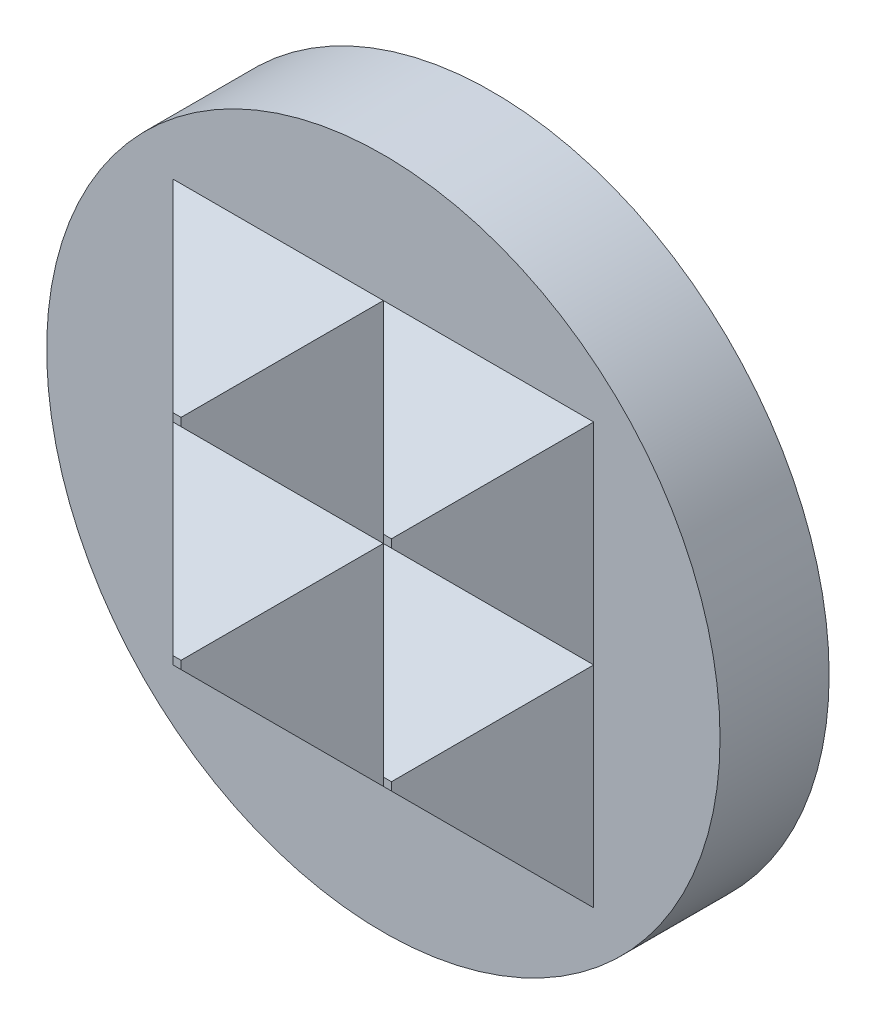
ISO-10303-21;
HEADER;
FILE_DESCRIPTION(('STEP AP214'),'2;1');
FILE_NAME('part.step','',(''),(''),'','','');
FILE_SCHEMA(('AUTOMOTIVE_DESIGN { 1 0 10303 214 1 1 1 1 }'));
ENDSEC;
DATA;
#1=APPLICATION_CONTEXT('core data for automotive mechanical design processes');
#2=APPLICATION_PROTOCOL_DEFINITION('international standard','automotive_design',2000,#1);
#3=PRODUCT_CONTEXT('',#1,'mechanical');
#4=PRODUCT('Part','Part','',(#3));
#5=PRODUCT_RELATED_PRODUCT_CATEGORY('part','',(#4));
#6=PRODUCT_DEFINITION_FORMATION('','',#4);
#7=PRODUCT_DEFINITION_CONTEXT('part definition',#1,'design');
#8=PRODUCT_DEFINITION('design','',#6,#7);
#9=PRODUCT_DEFINITION_SHAPE('','',#8);
#10=(LENGTH_UNIT() NAMED_UNIT(*) SI_UNIT(.MILLI.,.METRE.));
#11=(NAMED_UNIT(*) PLANE_ANGLE_UNIT() SI_UNIT($,.RADIAN.));
#12=(NAMED_UNIT(*) SI_UNIT($,.STERADIAN.) SOLID_ANGLE_UNIT());
#13=UNCERTAINTY_MEASURE_WITH_UNIT(LENGTH_MEASURE(1.E-05),#10,'distance_accuracy_value','');
#14=(GEOMETRIC_REPRESENTATION_CONTEXT(3) GLOBAL_UNCERTAINTY_ASSIGNED_CONTEXT((#13)) GLOBAL_UNIT_ASSIGNED_CONTEXT((#10,
#11,#12)) REPRESENTATION_CONTEXT('',''));
#15=CARTESIAN_POINT('',(0.,0.,0.));
#16=DIRECTION('',(0.,0.,1.));
#17=DIRECTION('',(1.,0.,0.));
#18=AXIS2_PLACEMENT_3D('',#15,#16,#17);
#19=CARTESIAN_POINT('',(6.351,3.96748,2.5654));
#20=DIRECTION('',(0.,-0.707106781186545,-0.70710678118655));
#21=DIRECTION('',(0.,0.70710678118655,-0.707106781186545));
#22=AXIS2_PLACEMENT_3D('',#19,#20,#21);
#23=PLANE('',#22);
#24=DIRECTION('',(-1.,0.,0.));
#25=VECTOR('',#24,1.);
#26=CARTESIAN_POINT('',(6.351,2.05994,4.47294));
#27=LINE('',#26,#25);
#28=CARTESIAN_POINT('',(2.05994,2.05994,4.47294));
#29=VERTEX_POINT('',#28);
#30=CARTESIAN_POINT('',(1.90754,2.05994,4.47294));
#31=VERTEX_POINT('',#30);
#32=EDGE_CURVE('E144',#29,#31,#27,.T.);
#33=ORIENTED_EDGE('',*,*,#32,.F.);
#34=DIRECTION('',(0.577350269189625,0.577350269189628,-0.577350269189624));
#35=VECTOR('',#34,1.);
#36=CARTESIAN_POINT('',(4.76198666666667,4.76198666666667,1.77089333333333));
#37=LINE('',#36,#35);
#38=CARTESIAN_POINT('',(3.96748,3.96748,2.5654));
#39=VERTEX_POINT('',#38);
#40=EDGE_CURVE('E220',#29,#39,#37,.T.);
#41=ORIENTED_EDGE('',*,*,#40,.T.);
#42=DIRECTION('',(-1.,0.,0.));
#43=VECTOR('',#42,1.);
#44=CARTESIAN_POINT('',(6.351,3.96748,2.5654));
#45=LINE('',#44,#43);
#46=CARTESIAN_POINT('',(0.,3.96748,2.5654));
#47=VERTEX_POINT('',#46);
#48=EDGE_CURVE('E157',#39,#47,#45,.T.);
#49=ORIENTED_EDGE('',*,*,#48,.T.);
#50=DIRECTION('',(0.577350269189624,-0.577350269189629,0.577350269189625));
#51=VECTOR('',#50,1.);
#52=CARTESIAN_POINT('',(2.117,1.85048,4.6824));
#53=LINE('',#52,#51);
#54=EDGE_CURVE('E187',#47,#31,#53,.T.);
#55=ORIENTED_EDGE('',*,*,#54,.T.);
#56=EDGE_LOOP('',(#33,#41,#49,#55));
#57=FACE_BOUND('',#56,.T.);
#58=ADVANCED_FACE('F14',(#57),#23,.F.);
#59=CARTESIAN_POINT('',(6.351,2.05994,4.47294));
#60=DIRECTION('',(0.,0.,-1.));
#61=DIRECTION('',(-1.,0.,0.));
#62=AXIS2_PLACEMENT_3D('',#59,#60,#61);
#63=PLANE('',#62);
#64=DIRECTION('',(-1.,0.,0.));
#65=VECTOR('',#64,1.);
#66=CARTESIAN_POINT('',(6.351,1.90754,4.47294));
#67=LINE('',#66,#65);
#68=CARTESIAN_POINT('',(2.05994,1.90754,4.47294));
#69=VERTEX_POINT('',#68);
#70=CARTESIAN_POINT('',(1.90754,1.90754,4.47294));
#71=VERTEX_POINT('',#70);
#72=EDGE_CURVE('E148',#69,#71,#67,.T.);
#73=ORIENTED_EDGE('',*,*,#72,.F.);
#74=DIRECTION('',(0.,1.,0.));
#75=VECTOR('',#74,1.);
#76=CARTESIAN_POINT('',(2.05994,2.05994,4.47294));
#77=LINE('',#76,#75);
#78=EDGE_CURVE('E222',#69,#29,#77,.T.);
#79=ORIENTED_EDGE('',*,*,#78,.T.);
#80=ORIENTED_EDGE('',*,*,#32,.T.);
#81=DIRECTION('',(0.,-1.,0.));
#82=VECTOR('',#81,1.);
#83=CARTESIAN_POINT('',(1.90754,2.05994,4.47294));
#84=LINE('',#83,#82);
#85=EDGE_CURVE('E189',#31,#71,#84,.T.);
#86=ORIENTED_EDGE('',*,*,#85,.T.);
#87=EDGE_LOOP('',(#73,#79,#80,#86));
#88=FACE_BOUND('',#87,.T.);
#89=ADVANCED_FACE('F285',(#88),#63,.F.);
#90=CARTESIAN_POINT('',(6.351,0.,2.5654));
#91=DIRECTION('',(0.,0.707106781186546,-0.70710678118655));
#92=DIRECTION('',(0.,0.70710678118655,0.707106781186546));
#93=AXIS2_PLACEMENT_3D('',#90,#91,#92);
#94=PLANE('',#93);
#95=DIRECTION('',(-1.,0.,0.));
#96=VECTOR('',#95,1.);
#97=CARTESIAN_POINT('',(6.351,0.,2.5654));
#98=LINE('',#97,#96);
#99=CARTESIAN_POINT('',(3.96748,0.,2.5654));
#100=VERTEX_POINT('',#99);
#101=CARTESIAN_POINT('',(0.,0.,2.5654));
#102=VERTEX_POINT('',#101);
#103=EDGE_CURVE('E18',#100,#102,#98,.T.);
#104=ORIENTED_EDGE('',*,*,#103,.F.);
#105=DIRECTION('',(-0.577350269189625,0.577350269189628,0.577350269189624));
#106=VECTOR('',#105,1.);
#107=CARTESIAN_POINT('',(4.76198666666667,-0.794506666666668,1.77089333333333));
#108=LINE('',#107,#106);
#109=EDGE_CURVE('E225',#100,#69,#108,.T.);
#110=ORIENTED_EDGE('',*,*,#109,.T.);
#111=ORIENTED_EDGE('',*,*,#72,.T.);
#112=DIRECTION('',(-0.577350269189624,-0.577350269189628,-0.577350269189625));
#113=VECTOR('',#112,1.);
#114=CARTESIAN_POINT('',(2.117,2.117,4.6824));
#115=LINE('',#114,#113);
#116=EDGE_CURVE('E192',#71,#102,#115,.T.);
#117=ORIENTED_EDGE('',*,*,#116,.T.);
#118=EDGE_LOOP('',(#104,#110,#111,#117));
#119=FACE_BOUND('',#118,.T.);
#120=ADVANCED_FACE('F246',(#119),#94,.F.);
#121=CARTESIAN_POINT('',(6.35105,-1.90754,4.47294));
#122=DIRECTION('',(0.,0.,-1.));
#123=DIRECTION('',(-1.,0.,0.));
#124=AXIS2_PLACEMENT_3D('',#121,#122,#123);
#125=PLANE('',#124);
#126=DIRECTION('',(-1.,0.,0.));
#127=VECTOR('',#126,1.);
#128=CARTESIAN_POINT('',(6.35105,-2.05994,4.47294));
#129=LINE('',#128,#127);
#130=CARTESIAN_POINT('',(2.05994,-2.05994,4.47294));
#131=VERTEX_POINT('',#130);
#132=CARTESIAN_POINT('',(1.90754,-2.05994,4.47294));
#133=VERTEX_POINT('',#132);
#134=EDGE_CURVE('E138',#131,#133,#129,.T.);
#135=ORIENTED_EDGE('',*,*,#134,.F.);
#136=DIRECTION('',(0.,1.,0.));
#137=VECTOR('',#136,1.);
#138=CARTESIAN_POINT('',(2.05994,-1.90754,4.47294));
#139=LINE('',#138,#137);
#140=CARTESIAN_POINT('',(2.05994,-1.90754,4.47294));
#141=VERTEX_POINT('',#140);
#142=EDGE_CURVE('E32',#131,#141,#139,.T.);
#143=ORIENTED_EDGE('',*,*,#142,.T.);
#144=DIRECTION('',(-1.,0.,0.));
#145=VECTOR('',#144,1.);
#146=CARTESIAN_POINT('',(6.35105,-1.90754,4.47294));
#147=LINE('',#146,#145);
#148=CARTESIAN_POINT('',(1.90754,-1.90754,4.47294));
#149=VERTEX_POINT('',#148);
#150=EDGE_CURVE('E119',#141,#149,#147,.T.);
#151=ORIENTED_EDGE('',*,*,#150,.T.);
#152=DIRECTION('',(0.,-1.,0.));
#153=VECTOR('',#152,1.);
#154=CARTESIAN_POINT('',(1.90754,-1.90754,4.47294));
#155=LINE('',#154,#153);
#156=EDGE_CURVE('E198',#149,#133,#155,.T.);
#157=ORIENTED_EDGE('',*,*,#156,.T.);
#158=EDGE_LOOP('',(#135,#143,#151,#157));
#159=FACE_BOUND('',#158,.T.);
#160=ADVANCED_FACE('F310',(#159),#125,.F.);
#161=CARTESIAN_POINT('',(6.35105,0.,2.5654));
#162=DIRECTION('',(0.,-0.707106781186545,-0.70710678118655));
#163=DIRECTION('',(0.,0.70710678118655,-0.707106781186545));
#164=AXIS2_PLACEMENT_3D('',#161,#162,#163);
#165=PLANE('',#164);
#166=ORIENTED_EDGE('',*,*,#150,.F.);
#167=DIRECTION('',(0.577350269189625,0.577350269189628,-0.577350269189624));
#168=VECTOR('',#167,1.);
#169=CARTESIAN_POINT('',(4.76200333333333,0.794523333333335,1.77087666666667));
#170=LINE('',#169,#168);
#171=EDGE_CURVE('E228',#141,#100,#170,.T.);
#172=ORIENTED_EDGE('',*,*,#171,.T.);
#173=ORIENTED_EDGE('',*,*,#103,.T.);
#174=DIRECTION('',(0.577350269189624,-0.577350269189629,0.577350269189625));
#175=VECTOR('',#174,1.);
#176=CARTESIAN_POINT('',(2.11701666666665,-2.11701666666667,4.68241666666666));
#177=LINE('',#176,#175);
#178=EDGE_CURVE('E195',#102,#149,#177,.T.);
#179=ORIENTED_EDGE('',*,*,#178,.T.);
#180=EDGE_LOOP('',(#166,#172,#173,#179));
#181=FACE_BOUND('',#180,.T.);
#182=ADVANCED_FACE('F243',(#181),#165,.F.);
#183=CARTESIAN_POINT('',(6.35105,-3.96748,2.5654));
#184=DIRECTION('',(0.,0.707106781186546,-0.70710678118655));
#185=DIRECTION('',(0.,0.70710678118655,0.707106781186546));
#186=AXIS2_PLACEMENT_3D('',#183,#184,#185);
#187=PLANE('',#186);
#188=DIRECTION('',(-1.,0.,0.));
#189=VECTOR('',#188,1.);
#190=CARTESIAN_POINT('',(6.35105,-3.96748,2.5654));
#191=LINE('',#190,#189);
#192=CARTESIAN_POINT('',(3.96748,-3.96748,2.5654));
#193=VERTEX_POINT('',#192);
#194=CARTESIAN_POINT('',(0.,-3.96748,2.5654));
#195=VERTEX_POINT('',#194);
#196=EDGE_CURVE('E117',#193,#195,#191,.T.);
#197=ORIENTED_EDGE('',*,*,#196,.F.);
#198=DIRECTION('',(-0.577350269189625,0.577350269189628,0.577350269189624));
#199=VECTOR('',#198,1.);
#200=CARTESIAN_POINT('',(4.76200333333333,-4.76200333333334,1.77087666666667));
#201=LINE('',#200,#199);
#202=EDGE_CURVE('E232',#193,#131,#201,.T.);
#203=ORIENTED_EDGE('',*,*,#202,.T.);
#204=ORIENTED_EDGE('',*,*,#134,.T.);
#205=DIRECTION('',(-0.577350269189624,-0.577350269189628,-0.577350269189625));
#206=VECTOR('',#205,1.);
#207=CARTESIAN_POINT('',(2.11701666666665,-1.85046333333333,4.68241666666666));
#208=LINE('',#207,#206);
#209=EDGE_CURVE('E201',#133,#195,#208,.T.);
#210=ORIENTED_EDGE('',*,*,#209,.T.);
#211=EDGE_LOOP('',(#197,#203,#204,#210));
#212=FACE_BOUND('',#211,.T.);
#213=ADVANCED_FACE('F296',(#212),#187,.F.);
#214=CARTESIAN_POINT('',(-1.90754,2.05994,4.47294));
#215=VERTEX_POINT('',#214);
#216=CARTESIAN_POINT('',(-2.05994,2.05994,4.47294));
#217=VERTEX_POINT('',#216);
#218=EDGE_CURVE('E147',#215,#217,#27,.T.);
#219=ORIENTED_EDGE('',*,*,#218,.F.);
#220=DIRECTION('',(0.577350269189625,0.577350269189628,-0.577350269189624));
#221=VECTOR('',#220,1.);
#222=CARTESIAN_POINT('',(2.117,6.08448,0.4484));
#223=LINE('',#222,#221);
#224=EDGE_CURVE('E172',#215,#47,#223,.T.);
#225=ORIENTED_EDGE('',*,*,#224,.T.);
#226=CARTESIAN_POINT('',(-3.96748,3.96748,2.5654));
#227=VERTEX_POINT('',#226);
#228=EDGE_CURVE('E140',#47,#227,#45,.T.);
#229=ORIENTED_EDGE('',*,*,#228,.T.);
#230=DIRECTION('',(0.577350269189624,-0.577350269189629,0.577350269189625));
#231=VECTOR('',#230,1.);
#232=CARTESIAN_POINT('',(-0.527986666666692,0.527986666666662,6.00489333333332));
#233=LINE('',#232,#231);
#234=EDGE_CURVE('E171',#227,#217,#233,.T.);
#235=ORIENTED_EDGE('',*,*,#234,.T.);
#236=EDGE_LOOP('',(#219,#225,#229,#235));
#237=FACE_BOUND('',#236,.T.);
#238=ADVANCED_FACE('F170',(#237),#23,.F.);
#239=CARTESIAN_POINT('',(-1.90754,1.90754,4.47294));
#240=VERTEX_POINT('',#239);
#241=CARTESIAN_POINT('',(-2.05994,1.90754,4.47294));
#242=VERTEX_POINT('',#241);
#243=EDGE_CURVE('E146',#240,#242,#67,.T.);
#244=ORIENTED_EDGE('',*,*,#243,.F.);
#245=DIRECTION('',(0.,1.,0.));
#246=VECTOR('',#245,1.);
#247=CARTESIAN_POINT('',(-1.90754,2.05994,4.47294));
#248=LINE('',#247,#246);
#249=EDGE_CURVE('E205',#240,#215,#248,.T.);
#250=ORIENTED_EDGE('',*,*,#249,.T.);
#251=ORIENTED_EDGE('',*,*,#218,.T.);
#252=DIRECTION('',(0.,-1.,0.));
#253=VECTOR('',#252,1.);
#254=CARTESIAN_POINT('',(-2.05994,2.05994,4.47294));
#255=LINE('',#254,#253);
#256=EDGE_CURVE('E179',#217,#242,#255,.T.);
#257=ORIENTED_EDGE('',*,*,#256,.T.);
#258=EDGE_LOOP('',(#244,#250,#251,#257));
#259=FACE_BOUND('',#258,.T.);
#260=ADVANCED_FACE('F293',(#259),#63,.F.);
#261=CARTESIAN_POINT('',(-3.96748,0.,2.5654));
#262=VERTEX_POINT('',#261);
#263=EDGE_CURVE('E149',#102,#262,#98,.T.);
#264=ORIENTED_EDGE('',*,*,#263,.F.);
#265=DIRECTION('',(-0.577350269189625,0.577350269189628,0.577350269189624));
#266=VECTOR('',#265,1.);
#267=CARTESIAN_POINT('',(2.117,-2.117,0.4484));
#268=LINE('',#267,#266);
#269=EDGE_CURVE('E208',#102,#240,#268,.T.);
#270=ORIENTED_EDGE('',*,*,#269,.T.);
#271=ORIENTED_EDGE('',*,*,#243,.T.);
#272=DIRECTION('',(-0.577350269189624,-0.577350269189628,-0.577350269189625));
#273=VECTOR('',#272,1.);
#274=CARTESIAN_POINT('',(-0.527986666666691,3.43949333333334,6.00489333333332));
#275=LINE('',#274,#273);
#276=EDGE_CURVE('E181',#242,#262,#275,.T.);
#277=ORIENTED_EDGE('',*,*,#276,.T.);
#278=EDGE_LOOP('',(#264,#270,#271,#277));
#279=FACE_BOUND('',#278,.T.);
#280=ADVANCED_FACE('F302',(#279),#94,.F.);
#281=CARTESIAN_POINT('',(-1.90754,-2.05994,4.47294));
#282=VERTEX_POINT('',#281);
#283=CARTESIAN_POINT('',(-2.05994,-2.05994,4.47294));
#284=VERTEX_POINT('',#283);
#285=EDGE_CURVE('E135',#282,#284,#129,.T.);
#286=ORIENTED_EDGE('',*,*,#285,.F.);
#287=DIRECTION('',(0.,1.,0.));
#288=VECTOR('',#287,1.);
#289=CARTESIAN_POINT('',(-1.90754,-1.90754,4.47294));
#290=LINE('',#289,#288);
#291=CARTESIAN_POINT('',(-1.90754,-1.90754,4.47294));
#292=VERTEX_POINT('',#291);
#293=EDGE_CURVE('E40',#282,#292,#290,.T.);
#294=ORIENTED_EDGE('',*,*,#293,.T.);
#295=CARTESIAN_POINT('',(-2.05994,-1.90754,4.47294));
#296=VERTEX_POINT('',#295);
#297=EDGE_CURVE('E180',#292,#296,#147,.T.);
#298=ORIENTED_EDGE('',*,*,#297,.T.);
#299=DIRECTION('',(0.,-1.,0.));
#300=VECTOR('',#299,1.);
#301=CARTESIAN_POINT('',(-2.05994,-1.90754,4.47294));
#302=LINE('',#301,#300);
#303=EDGE_CURVE('E130',#296,#284,#302,.T.);
#304=ORIENTED_EDGE('',*,*,#303,.T.);
#305=EDGE_LOOP('',(#286,#294,#298,#304));
#306=FACE_BOUND('',#305,.T.);
#307=ADVANCED_FACE('F319',(#306),#125,.F.);
#308=ORIENTED_EDGE('',*,*,#297,.F.);
#309=DIRECTION('',(0.577350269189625,0.577350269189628,-0.577350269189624));
#310=VECTOR('',#309,1.);
#311=CARTESIAN_POINT('',(2.11701666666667,2.11701666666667,0.44838333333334));
#312=LINE('',#311,#310);
#313=EDGE_CURVE('E211',#292,#102,#312,.T.);
#314=ORIENTED_EDGE('',*,*,#313,.T.);
#315=ORIENTED_EDGE('',*,*,#263,.T.);
#316=DIRECTION('',(0.577350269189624,-0.577350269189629,0.577350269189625));
#317=VECTOR('',#316,1.);
#318=CARTESIAN_POINT('',(-0.527970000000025,-3.43951,6.00491));
#319=LINE('',#318,#317);
#320=EDGE_CURVE('E128',#262,#296,#319,.T.);
#321=ORIENTED_EDGE('',*,*,#320,.T.);
#322=EDGE_LOOP('',(#308,#314,#315,#321));
#323=FACE_BOUND('',#322,.T.);
#324=ADVANCED_FACE('F312',(#323),#165,.F.);
#325=CARTESIAN_POINT('',(-3.96748,-3.96748,2.5654));
#326=VERTEX_POINT('',#325);
#327=EDGE_CURVE('E110',#195,#326,#191,.T.);
#328=ORIENTED_EDGE('',*,*,#327,.F.);
#329=DIRECTION('',(-0.577350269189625,0.577350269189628,0.577350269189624));
#330=VECTOR('',#329,1.);
#331=CARTESIAN_POINT('',(2.11701666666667,-6.08449666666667,0.44838333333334));
#332=LINE('',#331,#330);
#333=EDGE_CURVE('E136',#195,#282,#332,.T.);
#334=ORIENTED_EDGE('',*,*,#333,.T.);
#335=ORIENTED_EDGE('',*,*,#285,.T.);
#336=DIRECTION('',(-0.577350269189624,-0.577350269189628,-0.577350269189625));
#337=VECTOR('',#336,1.);
#338=CARTESIAN_POINT('',(-0.527970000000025,-0.52797,6.00491));
#339=LINE('',#338,#337);
#340=EDGE_CURVE('E9',#284,#326,#339,.T.);
#341=ORIENTED_EDGE('',*,*,#340,.T.);
#342=EDGE_LOOP('',(#328,#334,#335,#341));
#343=FACE_BOUND('',#342,.T.);
#344=ADVANCED_FACE('F133',(#343),#187,.F.);
#345=CARTESIAN_POINT('',(0.,0.,0.));
#346=DIRECTION('',(0.,0.,1.));
#347=DIRECTION('',(1.,0.,0.));
#348=AXIS2_PLACEMENT_3D('',#345,#346,#347);
#349=CYLINDRICAL_SURFACE('',#348,6.35);
#350=CARTESIAN_POINT('',(0.,0.,2.5654));
#351=DIRECTION('',(0.,0.,1.));
#352=DIRECTION('',(1.,0.,0.));
#353=AXIS2_PLACEMENT_3D('',#350,#351,#352);
#354=CIRCLE('',#353,6.35);
#355=CARTESIAN_POINT('',(6.35,0.,2.5654));
#356=VERTEX_POINT('',#355);
#357=EDGE_CURVE('E255',#356,#356,#354,.T.);
#358=ORIENTED_EDGE('',*,*,#357,.F.);
#359=EDGE_LOOP('',(#358));
#360=FACE_BOUND('',#359,.T.);
#361=CARTESIAN_POINT('',(0.,0.,0.508));
#362=DIRECTION('',(0.,0.,-1.));
#363=DIRECTION('',(-1.,0.,0.));
#364=AXIS2_PLACEMENT_3D('',#361,#362,#363);
#365=CIRCLE('',#364,6.35);
#366=CARTESIAN_POINT('',(-6.35,0.,0.508));
#367=VERTEX_POINT('',#366);
#368=EDGE_CURVE('E251',#367,#367,#365,.T.);
#369=ORIENTED_EDGE('',*,*,#368,.F.);
#370=EDGE_LOOP('',(#369));
#371=FACE_BOUND('',#370,.T.);
#372=ADVANCED_FACE('F16',(#360,#371),#349,.T.);
#373=CARTESIAN_POINT('',(0.,0.,2.5654));
#374=DIRECTION('',(0.,0.,1.));
#375=DIRECTION('',(1.,0.,0.));
#376=AXIS2_PLACEMENT_3D('',#373,#374,#375);
#377=PLANE('',#376);
#378=ORIENTED_EDGE('',*,*,#327,.T.);
#379=DIRECTION('',(0.,1.,0.));
#380=VECTOR('',#379,1.);
#381=CARTESIAN_POINT('',(-3.96748,-6.35,2.5654));
#382=LINE('',#381,#380);
#383=EDGE_CURVE('E114',#326,#262,#382,.T.);
#384=ORIENTED_EDGE('',*,*,#383,.T.);
#385=EDGE_CURVE('E131',#262,#227,#382,.T.);
#386=ORIENTED_EDGE('',*,*,#385,.T.);
#387=ORIENTED_EDGE('',*,*,#228,.F.);
#388=ORIENTED_EDGE('',*,*,#48,.F.);
#389=DIRECTION('',(0.,1.,0.));
#390=VECTOR('',#389,1.);
#391=CARTESIAN_POINT('',(3.96748,-6.35,2.5654));
#392=LINE('',#391,#390);
#393=EDGE_CURVE('E235',#100,#39,#392,.T.);
#394=ORIENTED_EDGE('',*,*,#393,.F.);
#395=EDGE_CURVE('E234',#193,#100,#392,.T.);
#396=ORIENTED_EDGE('',*,*,#395,.F.);
#397=ORIENTED_EDGE('',*,*,#196,.T.);
#398=EDGE_LOOP('',(#378,#384,#386,#387,#388,#394,#396,#397));
#399=FACE_BOUND('',#398,.T.);
#400=ORIENTED_EDGE('',*,*,#357,.T.);
#401=EDGE_LOOP('',(#400));
#402=FACE_BOUND('',#401,.T.);
#403=ADVANCED_FACE('F112',(#399,#402),#377,.T.);
#404=CARTESIAN_POINT('',(0.,0.,0.508));
#405=DIRECTION('',(0.,0.,-1.));
#406=DIRECTION('',(-1.,0.,0.));
#407=AXIS2_PLACEMENT_3D('',#404,#405,#406);
#408=PLANE('',#407);
#409=CARTESIAN_POINT('',(0.,0.,0.508));
#410=DIRECTION('',(0.,0.,-1.));
#411=DIRECTION('',(-1.,0.,0.));
#412=AXIS2_PLACEMENT_3D('',#409,#410,#411);
#413=CIRCLE('',#412,6.096);
#414=CARTESIAN_POINT('',(-6.096,0.,0.508));
#415=VERTEX_POINT('',#414);
#416=EDGE_CURVE('E249',#415,#415,#413,.T.);
#417=ORIENTED_EDGE('',*,*,#416,.F.);
#418=EDGE_LOOP('',(#417));
#419=FACE_BOUND('',#418,.T.);
#420=ORIENTED_EDGE('',*,*,#368,.T.);
#421=EDGE_LOOP('',(#420));
#422=FACE_BOUND('',#421,.T.);
#423=ADVANCED_FACE('F269',(#419,#422),#408,.T.);
#424=CARTESIAN_POINT('',(0.,0.,0.));
#425=DIRECTION('',(0.,0.,1.));
#426=DIRECTION('',(1.,0.,0.));
#427=AXIS2_PLACEMENT_3D('',#424,#425,#426);
#428=PLANE('',#427);
#429=CARTESIAN_POINT('',(0.,0.,0.));
#430=DIRECTION('',(0.,0.,1.));
#431=DIRECTION('',(1.,0.,0.));
#432=AXIS2_PLACEMENT_3D('',#429,#430,#431);
#433=CIRCLE('',#432,5.588);
#434=CARTESIAN_POINT('',(5.588,0.,0.));
#435=VERTEX_POINT('',#434);
#436=EDGE_CURVE('E24',#435,#435,#433,.F.);
#437=ORIENTED_EDGE('',*,*,#436,.T.);
#438=EDGE_LOOP('',(#437));
#439=FACE_BOUND('',#438,.T.);
#440=ADVANCED_FACE('F271',(#439),#428,.F.);
#441=CARTESIAN_POINT('',(0.,0.,0.));
#442=DIRECTION('',(0.,0.,1.));
#443=DIRECTION('',(1.,0.,0.));
#444=AXIS2_PLACEMENT_3D('',#441,#442,#443);
#445=CONICAL_SURFACE('',#444,5.588,0.785398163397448);
#446=ORIENTED_EDGE('',*,*,#416,.T.);
#447=EDGE_LOOP('',(#446));
#448=FACE_BOUND('',#447,.T.);
#449=ORIENTED_EDGE('',*,*,#436,.F.);
#450=EDGE_LOOP('',(#449));
#451=FACE_BOUND('',#450,.T.);
#452=ADVANCED_FACE('F280',(#448,#451),#445,.T.);
#453=CARTESIAN_POINT('',(-3.96748,-6.35,2.5654));
#454=DIRECTION('',(0.707106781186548,0.,-0.707106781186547));
#455=DIRECTION('',(-0.707106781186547,0.,-0.707106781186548));
#456=AXIS2_PLACEMENT_3D('',#453,#454,#455);
#457=PLANE('',#456);
#458=ORIENTED_EDGE('',*,*,#383,.F.);
#459=ORIENTED_EDGE('',*,*,#340,.F.);
#460=ORIENTED_EDGE('',*,*,#303,.F.);
#461=ORIENTED_EDGE('',*,*,#320,.F.);
#462=EDGE_LOOP('',(#458,#459,#460,#461));
#463=FACE_BOUND('',#462,.T.);
#464=ADVANCED_FACE('F124',(#463),#457,.F.);
#465=ORIENTED_EDGE('',*,*,#385,.F.);
#466=ORIENTED_EDGE('',*,*,#276,.F.);
#467=ORIENTED_EDGE('',*,*,#256,.F.);
#468=ORIENTED_EDGE('',*,*,#234,.F.);
#469=EDGE_LOOP('',(#465,#466,#467,#468));
#470=FACE_BOUND('',#469,.T.);
#471=ADVANCED_FACE('F176',(#470),#457,.F.);
#472=CARTESIAN_POINT('',(0.,-6.35,2.5654));
#473=DIRECTION('',(-0.707106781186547,0.,-0.707106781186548));
#474=DIRECTION('',(-0.707106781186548,0.,0.707106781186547));
#475=AXIS2_PLACEMENT_3D('',#472,#473,#474);
#476=PLANE('',#475);
#477=ORIENTED_EDGE('',*,*,#293,.F.);
#478=ORIENTED_EDGE('',*,*,#333,.F.);
#479=DIRECTION('',(0.,1.,0.));
#480=VECTOR('',#479,1.);
#481=CARTESIAN_POINT('',(0.,-6.35,2.5654));
#482=LINE('',#481,#480);
#483=EDGE_CURVE('E216',#195,#102,#482,.T.);
#484=ORIENTED_EDGE('',*,*,#483,.T.);
#485=ORIENTED_EDGE('',*,*,#313,.F.);
#486=EDGE_LOOP('',(#477,#478,#484,#485));
#487=FACE_BOUND('',#486,.T.);
#488=ADVANCED_FACE('F343',(#487),#476,.F.);
#489=CARTESIAN_POINT('',(0.,-6.35,2.5654));
#490=DIRECTION('',(0.707106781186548,0.,-0.707106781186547));
#491=DIRECTION('',(-0.707106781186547,0.,-0.707106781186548));
#492=AXIS2_PLACEMENT_3D('',#489,#490,#491);
#493=PLANE('',#492);
#494=ORIENTED_EDGE('',*,*,#483,.F.);
#495=ORIENTED_EDGE('',*,*,#209,.F.);
#496=ORIENTED_EDGE('',*,*,#156,.F.);
#497=ORIENTED_EDGE('',*,*,#178,.F.);
#498=EDGE_LOOP('',(#494,#495,#496,#497));
#499=FACE_BOUND('',#498,.T.);
#500=ADVANCED_FACE('F348',(#499),#493,.F.);
#501=EDGE_CURVE('E217',#102,#47,#482,.T.);
#502=ORIENTED_EDGE('',*,*,#501,.F.);
#503=ORIENTED_EDGE('',*,*,#116,.F.);
#504=ORIENTED_EDGE('',*,*,#85,.F.);
#505=ORIENTED_EDGE('',*,*,#54,.F.);
#506=EDGE_LOOP('',(#502,#503,#504,#505));
#507=FACE_BOUND('',#506,.T.);
#508=ADVANCED_FACE('F352',(#507),#493,.F.);
#509=ORIENTED_EDGE('',*,*,#249,.F.);
#510=ORIENTED_EDGE('',*,*,#269,.F.);
#511=ORIENTED_EDGE('',*,*,#501,.T.);
#512=ORIENTED_EDGE('',*,*,#224,.F.);
#513=EDGE_LOOP('',(#509,#510,#511,#512));
#514=FACE_BOUND('',#513,.T.);
#515=ADVANCED_FACE('F359',(#514),#476,.F.);
#516=CARTESIAN_POINT('',(3.96748,-6.35,2.5654));
#517=DIRECTION('',(-0.707106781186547,0.,-0.707106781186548));
#518=DIRECTION('',(-0.707106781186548,0.,0.707106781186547));
#519=AXIS2_PLACEMENT_3D('',#516,#517,#518);
#520=PLANE('',#519);
#521=ORIENTED_EDGE('',*,*,#142,.F.);
#522=ORIENTED_EDGE('',*,*,#202,.F.);
#523=ORIENTED_EDGE('',*,*,#395,.T.);
#524=ORIENTED_EDGE('',*,*,#171,.F.);
#525=EDGE_LOOP('',(#521,#522,#523,#524));
#526=FACE_BOUND('',#525,.T.);
#527=ADVANCED_FACE('F239',(#526),#520,.F.);
#528=ORIENTED_EDGE('',*,*,#78,.F.);
#529=ORIENTED_EDGE('',*,*,#109,.F.);
#530=ORIENTED_EDGE('',*,*,#393,.T.);
#531=ORIENTED_EDGE('',*,*,#40,.F.);
#532=EDGE_LOOP('',(#528,#529,#530,#531));
#533=FACE_BOUND('',#532,.T.);
#534=ADVANCED_FACE('F487',(#533),#520,.F.);
#535=CLOSED_SHELL('',(#58,#89,#120,#160,#182,#213,#238,#260,#280,#307,#324,#344,#372,#403,#423,
#440,#452,#464,#471,#488,#500,#508,#515,#527,#534));
#536=MANIFOLD_SOLID_BREP('B1',#535);
#537=ADVANCED_BREP_SHAPE_REPRESENTATION('',(#18,#536),#14);
#538=SHAPE_DEFINITION_REPRESENTATION(#9,#537);
ENDSEC;
END-ISO-10303-21;
